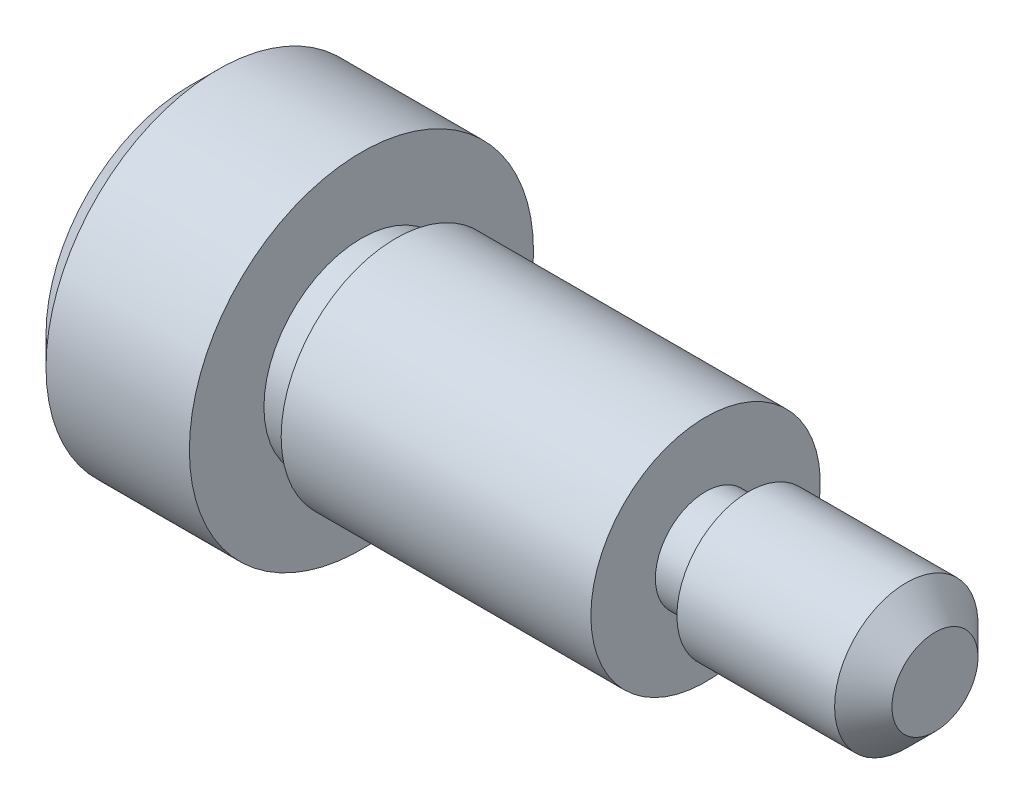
ISO-10303-21;
HEADER;
FILE_DESCRIPTION(('STEP AP214'),'2;1');
FILE_NAME('part.step','',(''),(''),'','','');
FILE_SCHEMA(('AUTOMOTIVE_DESIGN { 1 0 10303 214 1 1 1 1 }'));
ENDSEC;
DATA;
#1=APPLICATION_CONTEXT('core data for automotive mechanical design processes');
#2=APPLICATION_PROTOCOL_DEFINITION('international standard','automotive_design',2000,#1);
#3=PRODUCT_CONTEXT('',#1,'mechanical');
#4=PRODUCT('Part','Part','',(#3));
#5=PRODUCT_RELATED_PRODUCT_CATEGORY('part','',(#4));
#6=PRODUCT_DEFINITION_FORMATION('','',#4);
#7=PRODUCT_DEFINITION_CONTEXT('part definition',#1,'design');
#8=PRODUCT_DEFINITION('design','',#6,#7);
#9=PRODUCT_DEFINITION_SHAPE('','',#8);
#10=(LENGTH_UNIT() NAMED_UNIT(*) SI_UNIT(.MILLI.,.METRE.));
#11=(NAMED_UNIT(*) PLANE_ANGLE_UNIT() SI_UNIT($,.RADIAN.));
#12=(NAMED_UNIT(*) SI_UNIT($,.STERADIAN.) SOLID_ANGLE_UNIT());
#13=UNCERTAINTY_MEASURE_WITH_UNIT(LENGTH_MEASURE(1.E-05),#10,'distance_accuracy_value','');
#14=(GEOMETRIC_REPRESENTATION_CONTEXT(3) GLOBAL_UNCERTAINTY_ASSIGNED_CONTEXT((#13)) GLOBAL_UNIT_ASSIGNED_CONTEXT((#10,
#11,#12)) REPRESENTATION_CONTEXT('',''));
#15=CARTESIAN_POINT('',(0.,0.,0.));
#16=DIRECTION('',(0.,0.,1.));
#17=DIRECTION('',(1.,0.,0.));
#18=AXIS2_PLACEMENT_3D('',#15,#16,#17);
#19=CARTESIAN_POINT('',(0.,0.,0.));
#20=DIRECTION('',(-1.,0.,0.));
#21=DIRECTION('',(0.,0.,1.));
#22=AXIS2_PLACEMENT_3D('',#19,#20,#21);
#23=CYLINDRICAL_SURFACE('',#22,2.);
#24=CARTESIAN_POINT('',(6.,0.,0.));
#25=DIRECTION('',(-1.,0.,0.));
#26=DIRECTION('',(0.,0.,1.));
#27=AXIS2_PLACEMENT_3D('',#24,#25,#26);
#28=CIRCLE('',#27,2.);
#29=CARTESIAN_POINT('',(6.,0.,2.));
#30=VERTEX_POINT('',#29);
#31=EDGE_CURVE('E160',#30,#30,#28,.T.);
#32=ORIENTED_EDGE('',*,*,#31,.T.);
#33=EDGE_LOOP('',(#32));
#34=FACE_BOUND('',#33,.T.);
#35=CARTESIAN_POINT('',(0.600000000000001,0.,0.));
#36=DIRECTION('',(-1.,0.,0.));
#37=DIRECTION('',(0.,0.,1.));
#38=AXIS2_PLACEMENT_3D('',#35,#36,#37);
#39=CIRCLE('',#38,2.);
#40=CARTESIAN_POINT('',(0.600000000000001,0.,2.));
#41=VERTEX_POINT('',#40);
#42=EDGE_CURVE('E151',#41,#41,#39,.T.);
#43=ORIENTED_EDGE('',*,*,#42,.F.);
#44=EDGE_LOOP('',(#43));
#45=FACE_BOUND('',#44,.T.);
#46=ADVANCED_FACE('F34',(#34,#45),#23,.T.);
#47=CARTESIAN_POINT('',(6.,1.25,0.));
#48=DIRECTION('',(-1.,0.,0.));
#49=DIRECTION('',(0.,0.,1.));
#50=AXIS2_PLACEMENT_3D('',#47,#48,#49);
#51=PLANE('',#50);
#52=ORIENTED_EDGE('',*,*,#31,.F.);
#53=EDGE_LOOP('',(#52));
#54=FACE_BOUND('',#53,.T.);
#55=CARTESIAN_POINT('',(6.,0.,0.));
#56=DIRECTION('',(-1.,0.,0.));
#57=DIRECTION('',(0.,0.,1.));
#58=AXIS2_PLACEMENT_3D('',#55,#56,#57);
#59=CIRCLE('',#58,0.875000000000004);
#60=CARTESIAN_POINT('',(6.,0.,0.875000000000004));
#61=VERTEX_POINT('',#60);
#62=EDGE_CURVE('E145',#61,#61,#59,.T.);
#63=ORIENTED_EDGE('',*,*,#62,.T.);
#64=EDGE_LOOP('',(#63));
#65=FACE_BOUND('',#64,.T.);
#66=ADVANCED_FACE('F188',(#54,#65),#51,.F.);
#67=CARTESIAN_POINT('',(0.6,2.,0.));
#68=DIRECTION('',(-1.,0.,0.));
#69=DIRECTION('',(0.,0.,1.));
#70=AXIS2_PLACEMENT_3D('',#67,#68,#69);
#71=PLANE('',#70);
#72=ORIENTED_EDGE('',*,*,#42,.T.);
#73=EDGE_LOOP('',(#72));
#74=FACE_BOUND('',#73,.T.);
#75=CARTESIAN_POINT('',(0.6,0.,0.));
#76=DIRECTION('',(-1.,0.,0.));
#77=DIRECTION('',(0.,0.,1.));
#78=AXIS2_PLACEMENT_3D('',#75,#76,#77);
#79=CIRCLE('',#78,1.7);
#80=CARTESIAN_POINT('',(0.6,0.,1.7));
#81=VERTEX_POINT('',#80);
#82=EDGE_CURVE('E157',#81,#81,#79,.T.);
#83=ORIENTED_EDGE('',*,*,#82,.F.);
#84=EDGE_LOOP('',(#83));
#85=FACE_BOUND('',#84,.T.);
#86=ADVANCED_FACE('F194',(#74,#85),#71,.T.);
#87=CARTESIAN_POINT('',(0.,0.,0.));
#88=DIRECTION('',(-1.,0.,0.));
#89=DIRECTION('',(0.,0.,1.));
#90=AXIS2_PLACEMENT_3D('',#87,#88,#89);
#91=CYLINDRICAL_SURFACE('',#90,1.7);
#92=ORIENTED_EDGE('',*,*,#82,.T.);
#93=EDGE_LOOP('',(#92));
#94=FACE_BOUND('',#93,.T.);
#95=CARTESIAN_POINT('',(0.,0.,0.));
#96=DIRECTION('',(-1.,0.,0.));
#97=DIRECTION('',(0.,0.,1.));
#98=AXIS2_PLACEMENT_3D('',#95,#96,#97);
#99=CIRCLE('',#98,1.7);
#100=CARTESIAN_POINT('',(0.,0.,1.7));
#101=VERTEX_POINT('',#100);
#102=EDGE_CURVE('E154',#101,#101,#99,.T.);
#103=ORIENTED_EDGE('',*,*,#102,.F.);
#104=EDGE_LOOP('',(#103));
#105=FACE_BOUND('',#104,.T.);
#106=ADVANCED_FACE('F209',(#94,#105),#91,.T.);
#107=CARTESIAN_POINT('',(-3.,3.,0.));
#108=DIRECTION('',(1.,0.,0.));
#109=DIRECTION('',(0.,0.,-1.));
#110=AXIS2_PLACEMENT_3D('',#107,#108,#109);
#111=PLANE('',#110);
#112=CARTESIAN_POINT('',(-3.,0.,0.));
#113=DIRECTION('',(1.,0.,0.));
#114=DIRECTION('',(0.,0.,-1.));
#115=AXIS2_PLACEMENT_3D('',#112,#113,#114);
#116=CIRCLE('',#115,2.5);
#117=CARTESIAN_POINT('',(-3.,0.,-2.5));
#118=VERTEX_POINT('',#117);
#119=EDGE_CURVE('E42',#118,#118,#116,.F.);
#120=ORIENTED_EDGE('',*,*,#119,.T.);
#121=EDGE_LOOP('',(#120));
#122=FACE_BOUND('',#121,.T.);
#123=DIRECTION('',(0.,0.,-1.));
#124=VECTOR('',#123,1.);
#125=CARTESIAN_POINT('',(-3.,1.,0.577350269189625));
#126=LINE('',#125,#124);
#127=CARTESIAN_POINT('',(-3.,1.,0.577350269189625));
#128=VERTEX_POINT('',#127);
#129=CARTESIAN_POINT('',(-3.,0.999999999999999,-0.577350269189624));
#130=VERTEX_POINT('',#129);
#131=EDGE_CURVE('E103',#128,#130,#126,.T.);
#132=ORIENTED_EDGE('',*,*,#131,.F.);
#133=DIRECTION('',(0.,0.866025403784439,-0.5));
#134=VECTOR('',#133,1.);
#135=CARTESIAN_POINT('',(-3.,0.,1.15470053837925));
#136=LINE('',#135,#134);
#137=CARTESIAN_POINT('',(-3.,0.,1.15470053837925));
#138=VERTEX_POINT('',#137);
#139=EDGE_CURVE('E49',#138,#128,#136,.T.);
#140=ORIENTED_EDGE('',*,*,#139,.F.);
#141=DIRECTION('',(0.,0.866025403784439,0.5));
#142=VECTOR('',#141,1.);
#143=CARTESIAN_POINT('',(-3.,-1.,0.577350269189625));
#144=LINE('',#143,#142);
#145=CARTESIAN_POINT('',(-3.,-1.,0.577350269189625));
#146=VERTEX_POINT('',#145);
#147=EDGE_CURVE('E118',#146,#138,#144,.T.);
#148=ORIENTED_EDGE('',*,*,#147,.F.);
#149=DIRECTION('',(0.,0.,1.));
#150=VECTOR('',#149,1.);
#151=CARTESIAN_POINT('',(-3.,-1.,-0.577350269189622));
#152=LINE('',#151,#150);
#153=CARTESIAN_POINT('',(-3.,-1.,-0.577350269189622));
#154=VERTEX_POINT('',#153);
#155=EDGE_CURVE('E112',#154,#146,#152,.T.);
#156=ORIENTED_EDGE('',*,*,#155,.F.);
#157=DIRECTION('',(0.,-0.866025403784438,0.5));
#158=VECTOR('',#157,1.);
#159=CARTESIAN_POINT('',(-3.,0.,-1.15470053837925));
#160=LINE('',#159,#158);
#161=CARTESIAN_POINT('',(-3.,0.,-1.15470053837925));
#162=VERTEX_POINT('',#161);
#163=EDGE_CURVE('E110',#162,#154,#160,.T.);
#164=ORIENTED_EDGE('',*,*,#163,.F.);
#165=DIRECTION('',(0.,-0.866025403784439,-0.5));
#166=VECTOR('',#165,1.);
#167=CARTESIAN_POINT('',(-3.,0.999999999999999,-0.577350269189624));
#168=LINE('',#167,#166);
#169=EDGE_CURVE('E92',#130,#162,#168,.T.);
#170=ORIENTED_EDGE('',*,*,#169,.F.);
#171=EDGE_LOOP('',(#132,#140,#148,#156,#164,#170));
#172=FACE_BOUND('',#171,.T.);
#173=ADVANCED_FACE('F107',(#122,#172),#111,.F.);
#174=CARTESIAN_POINT('',(0.,0.,0.));
#175=DIRECTION('',(-1.,0.,0.));
#176=DIRECTION('',(0.,0.,1.));
#177=AXIS2_PLACEMENT_3D('',#174,#175,#176);
#178=CYLINDRICAL_SURFACE('',#177,3.);
#179=CARTESIAN_POINT('',(-2.5,0.,0.));
#180=DIRECTION('',(1.,0.,0.));
#181=DIRECTION('',(0.,0.,-1.));
#182=AXIS2_PLACEMENT_3D('',#179,#180,#181);
#183=CIRCLE('',#182,3.);
#184=CARTESIAN_POINT('',(-2.5,0.,-3.));
#185=VERTEX_POINT('',#184);
#186=EDGE_CURVE('E11',#185,#185,#183,.T.);
#187=ORIENTED_EDGE('',*,*,#186,.T.);
#188=EDGE_LOOP('',(#187));
#189=FACE_BOUND('',#188,.T.);
#190=CARTESIAN_POINT('',(0.,0.,0.));
#191=DIRECTION('',(-1.,0.,0.));
#192=DIRECTION('',(0.,0.,1.));
#193=AXIS2_PLACEMENT_3D('',#190,#191,#192);
#194=CIRCLE('',#193,3.);
#195=CARTESIAN_POINT('',(0.,0.,3.));
#196=VERTEX_POINT('',#195);
#197=EDGE_CURVE('E163',#196,#196,#194,.T.);
#198=ORIENTED_EDGE('',*,*,#197,.T.);
#199=EDGE_LOOP('',(#198));
#200=FACE_BOUND('',#199,.T.);
#201=ADVANCED_FACE('F204',(#189,#200),#178,.T.);
#202=CARTESIAN_POINT('',(0.,2.,0.));
#203=DIRECTION('',(-1.,0.,0.));
#204=DIRECTION('',(0.,0.,1.));
#205=AXIS2_PLACEMENT_3D('',#202,#203,#204);
#206=PLANE('',#205);
#207=ORIENTED_EDGE('',*,*,#197,.F.);
#208=EDGE_LOOP('',(#207));
#209=FACE_BOUND('',#208,.T.);
#210=ORIENTED_EDGE('',*,*,#102,.T.);
#211=EDGE_LOOP('',(#210));
#212=FACE_BOUND('',#211,.T.);
#213=ADVANCED_FACE('F200',(#209,#212),#206,.F.);
#214=CARTESIAN_POINT('',(6.75,1.25,0.));
#215=DIRECTION('',(-1.,0.,0.));
#216=DIRECTION('',(0.,0.,1.));
#217=AXIS2_PLACEMENT_3D('',#214,#215,#216);
#218=PLANE('',#217);
#219=CARTESIAN_POINT('',(6.75,0.,0.));
#220=DIRECTION('',(-1.,0.,0.));
#221=DIRECTION('',(0.,0.,1.));
#222=AXIS2_PLACEMENT_3D('',#219,#220,#221);
#223=CIRCLE('',#222,1.25);
#224=CARTESIAN_POINT('',(6.75,0.,1.25));
#225=VERTEX_POINT('',#224);
#226=EDGE_CURVE('E136',#225,#225,#223,.T.);
#227=ORIENTED_EDGE('',*,*,#226,.T.);
#228=EDGE_LOOP('',(#227));
#229=FACE_BOUND('',#228,.T.);
#230=CARTESIAN_POINT('',(6.75,0.,0.));
#231=DIRECTION('',(-1.,0.,0.));
#232=DIRECTION('',(0.,0.,1.));
#233=AXIS2_PLACEMENT_3D('',#230,#231,#232);
#234=CIRCLE('',#233,0.875000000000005);
#235=CARTESIAN_POINT('',(6.75,0.,0.875000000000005));
#236=VERTEX_POINT('',#235);
#237=EDGE_CURVE('E148',#236,#236,#234,.T.);
#238=ORIENTED_EDGE('',*,*,#237,.F.);
#239=EDGE_LOOP('',(#238));
#240=FACE_BOUND('',#239,.T.);
#241=ADVANCED_FACE('F203',(#229,#240),#218,.T.);
#242=CARTESIAN_POINT('',(0.,0.,0.));
#243=DIRECTION('',(-1.,0.,0.));
#244=DIRECTION('',(0.,0.,1.));
#245=AXIS2_PLACEMENT_3D('',#242,#243,#244);
#246=CYLINDRICAL_SURFACE('',#245,0.875000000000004);
#247=ORIENTED_EDGE('',*,*,#237,.T.);
#248=EDGE_LOOP('',(#247));
#249=FACE_BOUND('',#248,.T.);
#250=ORIENTED_EDGE('',*,*,#62,.F.);
#251=EDGE_LOOP('',(#250));
#252=FACE_BOUND('',#251,.T.);
#253=ADVANCED_FACE('F233',(#249,#252),#246,.T.);
#254=CARTESIAN_POINT('',(10.,0.,0.));
#255=DIRECTION('',(-1.,0.,0.));
#256=DIRECTION('',(0.,0.,1.));
#257=AXIS2_PLACEMENT_3D('',#254,#255,#256);
#258=PLANE('',#257);
#259=CARTESIAN_POINT('',(10.,0.,0.));
#260=DIRECTION('',(-1.,0.,0.));
#261=DIRECTION('',(0.,0.,1.));
#262=AXIS2_PLACEMENT_3D('',#259,#260,#261);
#263=CIRCLE('',#262,0.749999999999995);
#264=CARTESIAN_POINT('',(10.,0.,0.749999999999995));
#265=VERTEX_POINT('',#264);
#266=EDGE_CURVE('E169',#265,#265,#263,.F.);
#267=ORIENTED_EDGE('',*,*,#266,.T.);
#268=EDGE_LOOP('',(#267));
#269=FACE_BOUND('',#268,.T.);
#270=ADVANCED_FACE('F36',(#269),#258,.F.);
#271=CARTESIAN_POINT('',(0.,0.,0.));
#272=DIRECTION('',(-1.,0.,0.));
#273=DIRECTION('',(0.,0.,1.));
#274=AXIS2_PLACEMENT_3D('',#271,#272,#273);
#275=CYLINDRICAL_SURFACE('',#274,1.25);
#276=CARTESIAN_POINT('',(9.5,0.,0.));
#277=DIRECTION('',(-1.,0.,0.));
#278=DIRECTION('',(0.,0.,1.));
#279=AXIS2_PLACEMENT_3D('',#276,#277,#278);
#280=CIRCLE('',#279,1.25);
#281=CARTESIAN_POINT('',(9.5,0.,1.25));
#282=VERTEX_POINT('',#281);
#283=EDGE_CURVE('E166',#282,#282,#280,.T.);
#284=ORIENTED_EDGE('',*,*,#283,.T.);
#285=EDGE_LOOP('',(#284));
#286=FACE_BOUND('',#285,.T.);
#287=ORIENTED_EDGE('',*,*,#226,.F.);
#288=EDGE_LOOP('',(#287));
#289=FACE_BOUND('',#288,.T.);
#290=ADVANCED_FACE('F223',(#286,#289),#275,.T.);
#291=CARTESIAN_POINT('',(-1.4,0.,1.15470053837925));
#292=DIRECTION('',(0.,0.5,0.866025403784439));
#293=DIRECTION('',(0.,-0.866025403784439,0.5));
#294=AXIS2_PLACEMENT_3D('',#291,#292,#293);
#295=PLANE('',#294);
#296=ORIENTED_EDGE('',*,*,#139,.T.);
#297=DIRECTION('',(-1.,0.,0.));
#298=VECTOR('',#297,1.);
#299=CARTESIAN_POINT('',(-1.4,1.,0.577350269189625));
#300=LINE('',#299,#298);
#301=CARTESIAN_POINT('',(-1.4,1.,0.577350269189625));
#302=VERTEX_POINT('',#301);
#303=EDGE_CURVE('E100',#302,#128,#300,.T.);
#304=ORIENTED_EDGE('',*,*,#303,.F.);
#305=DIRECTION('',(0.,0.866025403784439,-0.5));
#306=VECTOR('',#305,1.);
#307=CARTESIAN_POINT('',(-1.4,0.,1.15470053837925));
#308=LINE('',#307,#306);
#309=CARTESIAN_POINT('',(-1.4,0.,1.15470053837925));
#310=VERTEX_POINT('',#309);
#311=EDGE_CURVE('E120',#310,#302,#308,.T.);
#312=ORIENTED_EDGE('',*,*,#311,.F.);
#313=DIRECTION('',(-1.,0.,0.));
#314=VECTOR('',#313,1.);
#315=CARTESIAN_POINT('',(-1.4,0.,1.15470053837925));
#316=LINE('',#315,#314);
#317=EDGE_CURVE('E56',#310,#138,#316,.T.);
#318=ORIENTED_EDGE('',*,*,#317,.T.);
#319=EDGE_LOOP('',(#296,#304,#312,#318));
#320=FACE_BOUND('',#319,.T.);
#321=ADVANCED_FACE('F225',(#320),#295,.F.);
#322=CARTESIAN_POINT('',(-1.4,-1.,0.577350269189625));
#323=DIRECTION('',(0.,-0.5,0.866025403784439));
#324=DIRECTION('',(0.,-0.866025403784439,-0.5));
#325=AXIS2_PLACEMENT_3D('',#322,#323,#324);
#326=PLANE('',#325);
#327=ORIENTED_EDGE('',*,*,#147,.T.);
#328=ORIENTED_EDGE('',*,*,#317,.F.);
#329=DIRECTION('',(0.,0.866025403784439,0.5));
#330=VECTOR('',#329,1.);
#331=CARTESIAN_POINT('',(-1.4,-1.,0.577350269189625));
#332=LINE('',#331,#330);
#333=CARTESIAN_POINT('',(-1.4,-1.,0.577350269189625));
#334=VERTEX_POINT('',#333);
#335=EDGE_CURVE('E132',#334,#310,#332,.T.);
#336=ORIENTED_EDGE('',*,*,#335,.F.);
#337=DIRECTION('',(-1.,0.,0.));
#338=VECTOR('',#337,1.);
#339=CARTESIAN_POINT('',(-1.4,-1.,0.577350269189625));
#340=LINE('',#339,#338);
#341=EDGE_CURVE('E137',#334,#146,#340,.T.);
#342=ORIENTED_EDGE('',*,*,#341,.T.);
#343=EDGE_LOOP('',(#327,#328,#336,#342));
#344=FACE_BOUND('',#343,.T.);
#345=ADVANCED_FACE('F231',(#344),#326,.F.);
#346=CARTESIAN_POINT('',(-1.4,-1.,-0.577350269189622));
#347=DIRECTION('',(0.,-1.,0.));
#348=DIRECTION('',(0.,0.,-1.));
#349=AXIS2_PLACEMENT_3D('',#346,#347,#348);
#350=PLANE('',#349);
#351=ORIENTED_EDGE('',*,*,#155,.T.);
#352=ORIENTED_EDGE('',*,*,#341,.F.);
#353=DIRECTION('',(0.,0.,1.));
#354=VECTOR('',#353,1.);
#355=CARTESIAN_POINT('',(-1.4,-1.,-0.577350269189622));
#356=LINE('',#355,#354);
#357=CARTESIAN_POINT('',(-1.4,-1.,-0.577350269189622));
#358=VERTEX_POINT('',#357);
#359=EDGE_CURVE('E129',#358,#334,#356,.T.);
#360=ORIENTED_EDGE('',*,*,#359,.F.);
#361=DIRECTION('',(-1.,0.,0.));
#362=VECTOR('',#361,1.);
#363=CARTESIAN_POINT('',(-1.4,-1.,-0.577350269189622));
#364=LINE('',#363,#362);
#365=EDGE_CURVE('E139',#358,#154,#364,.T.);
#366=ORIENTED_EDGE('',*,*,#365,.T.);
#367=EDGE_LOOP('',(#351,#352,#360,#366));
#368=FACE_BOUND('',#367,.T.);
#369=ADVANCED_FACE('F257',(#368),#350,.F.);
#370=CARTESIAN_POINT('',(-1.4,0.,-1.15470053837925));
#371=DIRECTION('',(0.,-0.5,-0.866025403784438));
#372=DIRECTION('',(0.,0.866025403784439,-0.5));
#373=AXIS2_PLACEMENT_3D('',#370,#371,#372);
#374=PLANE('',#373);
#375=ORIENTED_EDGE('',*,*,#163,.T.);
#376=ORIENTED_EDGE('',*,*,#365,.F.);
#377=DIRECTION('',(0.,-0.866025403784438,0.5));
#378=VECTOR('',#377,1.);
#379=CARTESIAN_POINT('',(-1.4,0.,-1.15470053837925));
#380=LINE('',#379,#378);
#381=CARTESIAN_POINT('',(-1.4,0.,-1.15470053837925));
#382=VERTEX_POINT('',#381);
#383=EDGE_CURVE('E126',#382,#358,#380,.T.);
#384=ORIENTED_EDGE('',*,*,#383,.F.);
#385=DIRECTION('',(-1.,0.,0.));
#386=VECTOR('',#385,1.);
#387=CARTESIAN_POINT('',(-1.4,0.,-1.15470053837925));
#388=LINE('',#387,#386);
#389=EDGE_CURVE('E99',#382,#162,#388,.T.);
#390=ORIENTED_EDGE('',*,*,#389,.T.);
#391=EDGE_LOOP('',(#375,#376,#384,#390));
#392=FACE_BOUND('',#391,.T.);
#393=ADVANCED_FACE('F254',(#392),#374,.F.);
#394=CARTESIAN_POINT('',(-1.4,0.999999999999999,-0.577350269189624));
#395=DIRECTION('',(0.,0.5,-0.866025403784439));
#396=DIRECTION('',(0.,0.866025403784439,0.5));
#397=AXIS2_PLACEMENT_3D('',#394,#395,#396);
#398=PLANE('',#397);
#399=ORIENTED_EDGE('',*,*,#169,.T.);
#400=ORIENTED_EDGE('',*,*,#389,.F.);
#401=DIRECTION('',(0.,-0.866025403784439,-0.5));
#402=VECTOR('',#401,1.);
#403=CARTESIAN_POINT('',(-1.4,0.999999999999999,-0.577350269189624));
#404=LINE('',#403,#402);
#405=CARTESIAN_POINT('',(-1.4,0.999999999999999,-0.577350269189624));
#406=VERTEX_POINT('',#405);
#407=EDGE_CURVE('E95',#406,#382,#404,.T.);
#408=ORIENTED_EDGE('',*,*,#407,.F.);
#409=DIRECTION('',(-1.,0.,0.));
#410=VECTOR('',#409,1.);
#411=CARTESIAN_POINT('',(-1.4,0.999999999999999,-0.577350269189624));
#412=LINE('',#411,#410);
#413=EDGE_CURVE('E88',#406,#130,#412,.T.);
#414=ORIENTED_EDGE('',*,*,#413,.T.);
#415=EDGE_LOOP('',(#399,#400,#408,#414));
#416=FACE_BOUND('',#415,.T.);
#417=ADVANCED_FACE('F90',(#416),#398,.F.);
#418=CARTESIAN_POINT('',(-1.4,1.,0.577350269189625));
#419=DIRECTION('',(0.,1.,0.));
#420=DIRECTION('',(0.,0.,1.));
#421=AXIS2_PLACEMENT_3D('',#418,#419,#420);
#422=PLANE('',#421);
#423=ORIENTED_EDGE('',*,*,#131,.T.);
#424=ORIENTED_EDGE('',*,*,#413,.F.);
#425=DIRECTION('',(0.,0.,-1.));
#426=VECTOR('',#425,1.);
#427=CARTESIAN_POINT('',(-1.4,1.,0.577350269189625));
#428=LINE('',#427,#426);
#429=EDGE_CURVE('E123',#302,#406,#428,.T.);
#430=ORIENTED_EDGE('',*,*,#429,.F.);
#431=ORIENTED_EDGE('',*,*,#303,.T.);
#432=EDGE_LOOP('',(#423,#424,#430,#431));
#433=FACE_BOUND('',#432,.T.);
#434=ADVANCED_FACE('F104',(#433),#422,.F.);
#435=CARTESIAN_POINT('',(-1.4,1.,0.577350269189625));
#436=DIRECTION('',(-1.,0.,0.));
#437=DIRECTION('',(0.,0.,1.));
#438=AXIS2_PLACEMENT_3D('',#435,#436,#437);
#439=PLANE('',#438);
#440=ORIENTED_EDGE('',*,*,#311,.T.);
#441=ORIENTED_EDGE('',*,*,#429,.T.);
#442=ORIENTED_EDGE('',*,*,#407,.T.);
#443=ORIENTED_EDGE('',*,*,#383,.T.);
#444=ORIENTED_EDGE('',*,*,#359,.T.);
#445=ORIENTED_EDGE('',*,*,#335,.T.);
#446=EDGE_LOOP('',(#440,#441,#442,#443,#444,#445));
#447=FACE_BOUND('',#446,.T.);
#448=ADVANCED_FACE('F183',(#447),#439,.T.);
#449=CARTESIAN_POINT('',(9.5,0.,0.));
#450=DIRECTION('',(-1.,0.,0.));
#451=DIRECTION('',(0.,0.,1.));
#452=AXIS2_PLACEMENT_3D('',#449,#450,#451);
#453=CONICAL_SURFACE('',#452,1.25,0.78539816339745);
#454=ORIENTED_EDGE('',*,*,#266,.F.);
#455=EDGE_LOOP('',(#454));
#456=FACE_BOUND('',#455,.T.);
#457=ORIENTED_EDGE('',*,*,#283,.F.);
#458=EDGE_LOOP('',(#457));
#459=FACE_BOUND('',#458,.T.);
#460=ADVANCED_FACE('F177',(#456,#459),#453,.T.);
#461=CARTESIAN_POINT('',(-3.,0.,0.));
#462=DIRECTION('',(1.,0.,0.));
#463=DIRECTION('',(0.,0.,-1.));
#464=AXIS2_PLACEMENT_3D('',#461,#462,#463);
#465=CONICAL_SURFACE('',#464,2.5,0.785398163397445);
#466=ORIENTED_EDGE('',*,*,#186,.F.);
#467=EDGE_LOOP('',(#466));
#468=FACE_BOUND('',#467,.T.);
#469=ORIENTED_EDGE('',*,*,#119,.F.);
#470=EDGE_LOOP('',(#469));
#471=FACE_BOUND('',#470,.T.);
#472=ADVANCED_FACE('F175',(#468,#471),#465,.T.);
#473=CLOSED_SHELL('',(#46,#66,#86,#106,#173,#201,#213,#241,#253,#270,#290,#321,#345,#369,#393,
#417,#434,#448,#460,#472));
#474=MANIFOLD_SOLID_BREP('B2',#473);
#475=ADVANCED_BREP_SHAPE_REPRESENTATION('',(#18,#474),#14);
#476=SHAPE_DEFINITION_REPRESENTATION(#9,#475);
ENDSEC;
END-ISO-10303-21;
